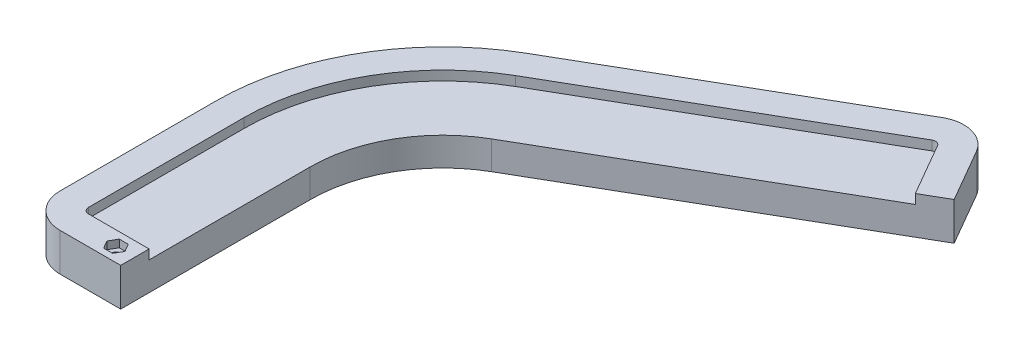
from build123d import *

# Parameters (mm, degrees)
EXTRUDE1_DEPTH = 20
FILLET1_R      = 18
SHELL1_T       = -15
HEX_2_DEPTH    = 4
SKETCH4_R      = 2
THRU_DEPTH     = 306.263899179


with BuildPart() as part:
    # Sketch2 → Extrude1 (new body)
    with BuildSketch(Plane(origin=(0, 0, 0), x_dir=(1, 0, 0), z_dir=(0, 1, 0))):
        with BuildLine():
            Line((0, 0), (0, 100))
            ThreePointArc((0, 100), (9.378221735, 135), (35, 160.621778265))
            Line((35, 160.621778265), (189.807621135, 250))
            Line((189.807621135, 250), (164.807621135, 293.301270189))
            Line((164.807621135, 293.301270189), (10, 203.923048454))
            ThreePointArc((10, 203.923048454), (-33.923048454, 160), (-50, 100))
            Line((-50, 100), (-50, 0))
            Line((-50, 0), (0, 0))
        make_face()
    extrude(amount=EXTRUDE1_DEPTH)

    # Fillet1
    fillet1_edges = [part.edges().sort_by_distance(p)[0] for p in [
        (-50, 10, 0),
        (164.807621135, 10, -293.301270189),
    ]]
    fillet(fillet1_edges, radius=FILLET1_R)

    # Shell1
    shell1_openings = [part.faces().sort_by_distance(p)[0] for p in [
        (-46.262194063, 20, -59),
        (112.403810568, 10, -205.310889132),
        (9.378221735, 10, -135),
        (0, 10, -50),
    ]]
    offset(amount=SHELL1_T, openings=shell1_openings, kind=Kind.INTERSECTION)

    # Sketch21 → Hex 2 (cut)
    with BuildSketch(Plane(origin=(17.499906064, 20, -35.236970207), x_dir=(-1, 0, 0), z_dir=(0, 1, 0))):
        Polygon((29.881475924, 23.611970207), (32.263045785, 27.736970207), (29.881475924, 31.861970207), (25.118336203, 31.861970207), (22.736766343, 27.736970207), (25.118336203, 23.611970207), align=None)
    extrude(amount=-HEX_2_DEPTH, mode=Mode.SUBTRACT)

    # Sketch4 → Thru (cut, through all)
    with BuildSketch(Plane(origin=(17.499906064, 16, -35.236970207), x_dir=(-1, 0, 0), z_dir=(0, 1, 0))):
        with Locations(Location((27.499906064, 27.736970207, 0), (0, 0, 90))):
            Circle(SKETCH4_R)
    extrude(amount=-THRU_DEPTH, mode=Mode.SUBTRACT)


solid = part.part
